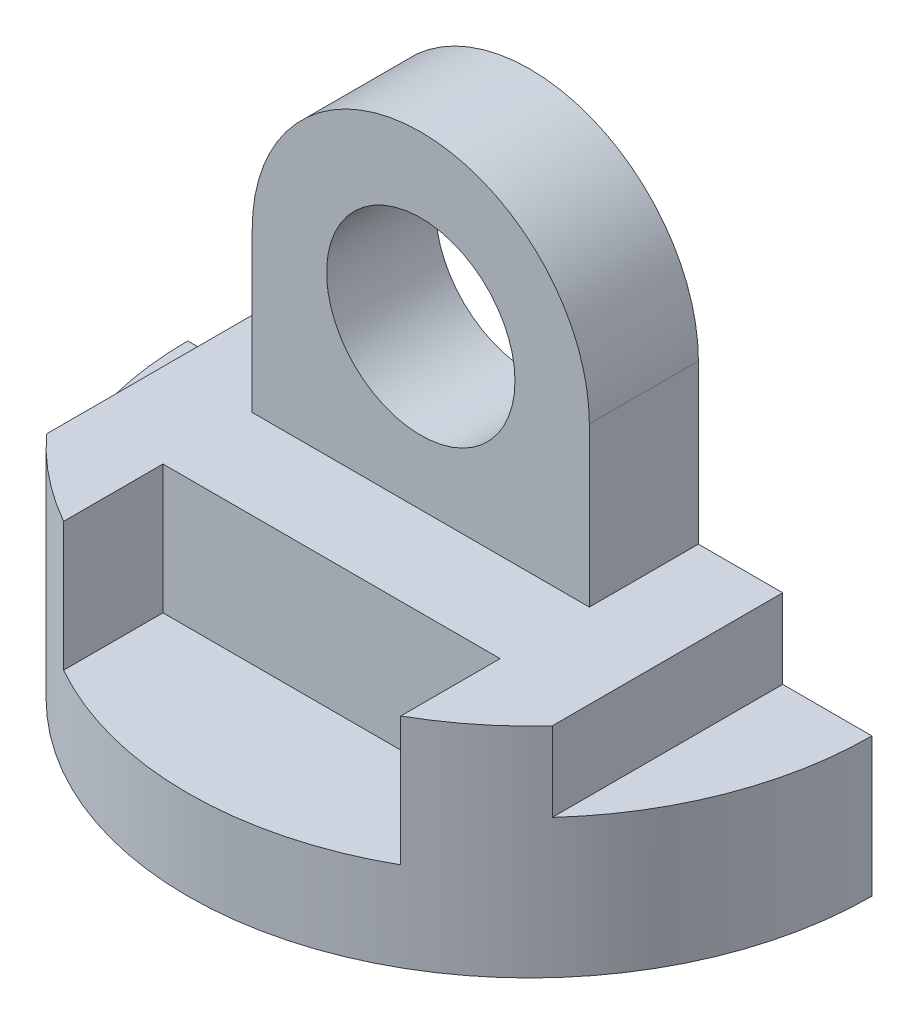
ISO-10303-21;
HEADER;
FILE_DESCRIPTION(('STEP AP214'),'2;1');
FILE_NAME('part.step','',(''),(''),'','','');
FILE_SCHEMA(('AUTOMOTIVE_DESIGN { 1 0 10303 214 1 1 1 1 }'));
ENDSEC;
DATA;
#1=APPLICATION_CONTEXT('core data for automotive mechanical design processes');
#2=APPLICATION_PROTOCOL_DEFINITION('international standard','automotive_design',2000,#1);
#3=PRODUCT_CONTEXT('',#1,'mechanical');
#4=PRODUCT('Part','Part','',(#3));
#5=PRODUCT_RELATED_PRODUCT_CATEGORY('part','',(#4));
#6=PRODUCT_DEFINITION_FORMATION('','',#4);
#7=PRODUCT_DEFINITION_CONTEXT('part definition',#1,'design');
#8=PRODUCT_DEFINITION('design','',#6,#7);
#9=PRODUCT_DEFINITION_SHAPE('','',#8);
#10=(LENGTH_UNIT() NAMED_UNIT(*) SI_UNIT(.MILLI.,.METRE.));
#11=(NAMED_UNIT(*) PLANE_ANGLE_UNIT() SI_UNIT($,.RADIAN.));
#12=(NAMED_UNIT(*) SI_UNIT($,.STERADIAN.) SOLID_ANGLE_UNIT());
#13=UNCERTAINTY_MEASURE_WITH_UNIT(LENGTH_MEASURE(1.E-05),#10,'distance_accuracy_value','');
#14=(GEOMETRIC_REPRESENTATION_CONTEXT(3) GLOBAL_UNCERTAINTY_ASSIGNED_CONTEXT((#13)) GLOBAL_UNIT_ASSIGNED_CONTEXT((#10,
#11,#12)) REPRESENTATION_CONTEXT('',''));
#15=CARTESIAN_POINT('',(0.,0.,0.));
#16=DIRECTION('',(0.,0.,1.));
#17=DIRECTION('',(1.,0.,0.));
#18=AXIS2_PLACEMENT_3D('',#15,#16,#17);
#19=CARTESIAN_POINT('',(0.,88.,0.));
#20=DIRECTION('',(0.,-1.,0.));
#21=DIRECTION('',(0.,0.,-1.));
#22=AXIS2_PLACEMENT_3D('',#19,#20,#21);
#23=CYLINDRICAL_SURFACE('',#22,138.);
#24=CARTESIAN_POINT('',(0.,56.,0.));
#25=DIRECTION('',(0.,1.,0.));
#26=DIRECTION('',(0.,0.,1.));
#27=AXIS2_PLACEMENT_3D('',#24,#25,#26);
#28=CIRCLE('',#27,138.);
#29=CARTESIAN_POINT('',(102.,56.,92.951600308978));
#30=VERTEX_POINT('',#29);
#31=CARTESIAN_POINT('',(138.,56.,0.));
#32=VERTEX_POINT('',#31);
#33=EDGE_CURVE('E143',#30,#32,#28,.T.);
#34=ORIENTED_EDGE('',*,*,#33,.F.);
#35=DIRECTION('',(0.,-1.,0.));
#36=VECTOR('',#35,1.);
#37=CARTESIAN_POINT('',(102.,88.,92.951600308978));
#38=LINE('',#37,#36);
#39=CARTESIAN_POINT('',(102.,88.,92.951600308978));
#40=VERTEX_POINT('',#39);
#41=EDGE_CURVE('E131',#30,#40,#38,.F.);
#42=ORIENTED_EDGE('',*,*,#41,.T.);
#43=CARTESIAN_POINT('',(0.,88.,0.));
#44=DIRECTION('',(0.,1.,0.));
#45=DIRECTION('',(0.,0.,1.));
#46=AXIS2_PLACEMENT_3D('',#43,#44,#45);
#47=CIRCLE('',#46,138.);
#48=CARTESIAN_POINT('',(68.,88.,120.083304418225));
#49=VERTEX_POINT('',#48);
#50=EDGE_CURVE('E141',#49,#40,#47,.T.);
#51=ORIENTED_EDGE('',*,*,#50,.F.);
#52=DIRECTION('',(0.,-1.,0.));
#53=VECTOR('',#52,1.);
#54=CARTESIAN_POINT('',(68.,88.,120.083304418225));
#55=LINE('',#54,#53);
#56=CARTESIAN_POINT('',(68.,36.,120.083304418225));
#57=VERTEX_POINT('',#56);
#58=EDGE_CURVE('E253',#49,#57,#55,.T.);
#59=ORIENTED_EDGE('',*,*,#58,.T.);
#60=CARTESIAN_POINT('',(0.,36.,0.));
#61=DIRECTION('',(0.,-1.,0.));
#62=DIRECTION('',(0.,0.,-1.));
#63=AXIS2_PLACEMENT_3D('',#60,#61,#62);
#64=CIRCLE('',#63,138.);
#65=CARTESIAN_POINT('',(-68.,36.,120.083304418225));
#66=VERTEX_POINT('',#65);
#67=EDGE_CURVE('E173',#57,#66,#64,.T.);
#68=ORIENTED_EDGE('',*,*,#67,.T.);
#69=DIRECTION('',(0.,-1.,0.));
#70=VECTOR('',#69,1.);
#71=CARTESIAN_POINT('',(-68.,88.,120.083304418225));
#72=LINE('',#71,#70);
#73=CARTESIAN_POINT('',(-68.,88.,120.083304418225));
#74=VERTEX_POINT('',#73);
#75=EDGE_CURVE('E257',#66,#74,#72,.F.);
#76=ORIENTED_EDGE('',*,*,#75,.T.);
#77=CARTESIAN_POINT('',(-102.,88.,92.951600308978));
#78=VERTEX_POINT('',#77);
#79=EDGE_CURVE('E149',#78,#74,#47,.T.);
#80=ORIENTED_EDGE('',*,*,#79,.F.);
#81=DIRECTION('',(0.,-1.,0.));
#82=VECTOR('',#81,1.);
#83=CARTESIAN_POINT('',(-102.,88.,92.951600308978));
#84=LINE('',#83,#82);
#85=CARTESIAN_POINT('',(-102.,56.,92.951600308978));
#86=VERTEX_POINT('',#85);
#87=EDGE_CURVE('E53',#86,#78,#84,.F.);
#88=ORIENTED_EDGE('',*,*,#87,.F.);
#89=CARTESIAN_POINT('',(0.,56.,0.));
#90=DIRECTION('',(0.,1.,0.));
#91=DIRECTION('',(0.,0.,1.));
#92=AXIS2_PLACEMENT_3D('',#89,#90,#91);
#93=CIRCLE('',#92,138.);
#94=CARTESIAN_POINT('',(-138.,56.,0.));
#95=VERTEX_POINT('',#94);
#96=EDGE_CURVE('E234',#95,#86,#93,.T.);
#97=ORIENTED_EDGE('',*,*,#96,.F.);
#98=DIRECTION('',(0.,-1.,0.));
#99=VECTOR('',#98,1.);
#100=CARTESIAN_POINT('',(-138.,88.,0.));
#101=LINE('',#100,#99);
#102=CARTESIAN_POINT('',(-138.,0.,0.));
#103=VERTEX_POINT('',#102);
#104=EDGE_CURVE('E169',#95,#103,#101,.T.);
#105=ORIENTED_EDGE('',*,*,#104,.T.);
#106=CARTESIAN_POINT('',(0.,0.,0.));
#107=DIRECTION('',(0.,1.,0.));
#108=DIRECTION('',(0.,0.,1.));
#109=AXIS2_PLACEMENT_3D('',#106,#107,#108);
#110=CIRCLE('',#109,138.);
#111=CARTESIAN_POINT('',(138.,0.,0.));
#112=VERTEX_POINT('',#111);
#113=EDGE_CURVE('E154',#103,#112,#110,.T.);
#114=ORIENTED_EDGE('',*,*,#113,.T.);
#115=DIRECTION('',(0.,-1.,0.));
#116=VECTOR('',#115,1.);
#117=CARTESIAN_POINT('',(138.,88.,0.));
#118=LINE('',#117,#116);
#119=EDGE_CURVE('E177',#32,#112,#118,.T.);
#120=ORIENTED_EDGE('',*,*,#119,.F.);
#121=EDGE_LOOP('',(#34,#42,#51,#59,#68,#76,#80,#88,#97,#105,#114,#120));
#122=FACE_BOUND('',#121,.T.);
#123=ADVANCED_FACE('F31',(#122),#23,.T.);
#124=CARTESIAN_POINT('',(138.,88.,0.));
#125=DIRECTION('',(0.,0.,1.));
#126=DIRECTION('',(1.,0.,0.));
#127=AXIS2_PLACEMENT_3D('',#124,#125,#126);
#128=PLANE('',#127);
#129=CARTESIAN_POINT('',(0.,152.,0.));
#130=DIRECTION('',(0.,0.,1.));
#131=DIRECTION('',(1.,0.,0.));
#132=AXIS2_PLACEMENT_3D('',#129,#130,#131);
#133=CIRCLE('',#132,38.);
#134=CARTESIAN_POINT('',(38.,152.,0.));
#135=VERTEX_POINT('',#134);
#136=EDGE_CURVE('E184',#135,#135,#133,.T.);
#137=ORIENTED_EDGE('',*,*,#136,.T.);
#138=EDGE_LOOP('',(#137));
#139=FACE_BOUND('',#138,.T.);
#140=DIRECTION('',(-1.,0.,0.));
#141=VECTOR('',#140,1.);
#142=CARTESIAN_POINT('',(138.,88.,0.));
#143=LINE('',#142,#141);
#144=CARTESIAN_POINT('',(102.,88.,0.));
#145=VERTEX_POINT('',#144);
#146=CARTESIAN_POINT('',(68.,88.,0.));
#147=VERTEX_POINT('',#146);
#148=EDGE_CURVE('E167',#145,#147,#143,.T.);
#149=ORIENTED_EDGE('',*,*,#148,.F.);
#150=DIRECTION('',(0.,-1.,0.));
#151=VECTOR('',#150,1.);
#152=CARTESIAN_POINT('',(102.,88.,0.));
#153=LINE('',#152,#151);
#154=CARTESIAN_POINT('',(102.,56.,0.));
#155=VERTEX_POINT('',#154);
#156=EDGE_CURVE('E45',#145,#155,#153,.T.);
#157=ORIENTED_EDGE('',*,*,#156,.T.);
#158=DIRECTION('',(-1.,0.,0.));
#159=VECTOR('',#158,1.);
#160=CARTESIAN_POINT('',(138.,56.,0.));
#161=LINE('',#160,#159);
#162=EDGE_CURVE('E11',#32,#155,#161,.T.);
#163=ORIENTED_EDGE('',*,*,#162,.F.);
#164=ORIENTED_EDGE('',*,*,#119,.T.);
#165=DIRECTION('',(-1.,0.,0.));
#166=VECTOR('',#165,1.);
#167=CARTESIAN_POINT('',(138.,0.,0.));
#168=LINE('',#167,#166);
#169=EDGE_CURVE('E150',#112,#103,#168,.T.);
#170=ORIENTED_EDGE('',*,*,#169,.T.);
#171=ORIENTED_EDGE('',*,*,#104,.F.);
#172=DIRECTION('',(-1.,0.,0.));
#173=VECTOR('',#172,1.);
#174=CARTESIAN_POINT('',(138.,56.,0.));
#175=LINE('',#174,#173);
#176=CARTESIAN_POINT('',(-102.,56.,0.));
#177=VERTEX_POINT('',#176);
#178=EDGE_CURVE('E136',#177,#95,#175,.T.);
#179=ORIENTED_EDGE('',*,*,#178,.F.);
#180=DIRECTION('',(0.,-1.,0.));
#181=VECTOR('',#180,1.);
#182=CARTESIAN_POINT('',(-102.,88.,0.));
#183=LINE('',#182,#181);
#184=CARTESIAN_POINT('',(-102.,88.,0.));
#185=VERTEX_POINT('',#184);
#186=EDGE_CURVE('E231',#185,#177,#183,.T.);
#187=ORIENTED_EDGE('',*,*,#186,.F.);
#188=CARTESIAN_POINT('',(-68.,88.,0.));
#189=VERTEX_POINT('',#188);
#190=EDGE_CURVE('E152',#189,#185,#143,.T.);
#191=ORIENTED_EDGE('',*,*,#190,.F.);
#192=DIRECTION('',(0.,-1.,0.));
#193=VECTOR('',#192,1.);
#194=CARTESIAN_POINT('',(-68.,88.,0.));
#195=LINE('',#194,#193);
#196=CARTESIAN_POINT('',(-68.,152.,0.));
#197=VERTEX_POINT('',#196);
#198=EDGE_CURVE('E194',#197,#189,#195,.T.);
#199=ORIENTED_EDGE('',*,*,#198,.F.);
#200=CARTESIAN_POINT('',(0.,152.,0.));
#201=DIRECTION('',(0.,0.,1.));
#202=DIRECTION('',(1.,0.,0.));
#203=AXIS2_PLACEMENT_3D('',#200,#201,#202);
#204=CIRCLE('',#203,68.);
#205=CARTESIAN_POINT('',(68.,152.,0.));
#206=VERTEX_POINT('',#205);
#207=EDGE_CURVE('E183',#206,#197,#204,.T.);
#208=ORIENTED_EDGE('',*,*,#207,.F.);
#209=DIRECTION('',(0.,1.,0.));
#210=VECTOR('',#209,1.);
#211=CARTESIAN_POINT('',(68.,88.,0.));
#212=LINE('',#211,#210);
#213=EDGE_CURVE('E180',#147,#206,#212,.T.);
#214=ORIENTED_EDGE('',*,*,#213,.F.);
#215=EDGE_LOOP('',(#149,#157,#163,#164,#170,#171,#179,#187,#191,#199,#208,#214));
#216=FACE_BOUND('',#215,.T.);
#217=ADVANCED_FACE('F218',(#139,#216),#128,.F.);
#218=CARTESIAN_POINT('',(0.,88.,0.));
#219=DIRECTION('',(0.,1.,0.));
#220=DIRECTION('',(0.,0.,1.));
#221=AXIS2_PLACEMENT_3D('',#218,#219,#220);
#222=PLANE('',#221);
#223=DIRECTION('',(0.,0.,1.));
#224=VECTOR('',#223,1.);
#225=CARTESIAN_POINT('',(102.,88.,0.));
#226=LINE('',#225,#224);
#227=EDGE_CURVE('E38',#145,#40,#226,.T.);
#228=ORIENTED_EDGE('',*,*,#227,.F.);
#229=ORIENTED_EDGE('',*,*,#148,.T.);
#230=DIRECTION('',(0.,0.,-1.));
#231=VECTOR('',#230,1.);
#232=CARTESIAN_POINT('',(68.,88.,44.));
#233=LINE('',#232,#231);
#234=CARTESIAN_POINT('',(68.,88.,44.));
#235=VERTEX_POINT('',#234);
#236=EDGE_CURVE('E187',#235,#147,#233,.T.);
#237=ORIENTED_EDGE('',*,*,#236,.F.);
#238=DIRECTION('',(1.,0.,0.));
#239=VECTOR('',#238,1.);
#240=CARTESIAN_POINT('',(68.,88.,44.));
#241=LINE('',#240,#239);
#242=CARTESIAN_POINT('',(-68.,88.,44.));
#243=VERTEX_POINT('',#242);
#244=EDGE_CURVE('E191',#243,#235,#241,.T.);
#245=ORIENTED_EDGE('',*,*,#244,.F.);
#246=DIRECTION('',(0.,0.,-1.));
#247=VECTOR('',#246,1.);
#248=CARTESIAN_POINT('',(-68.,88.,44.));
#249=LINE('',#248,#247);
#250=EDGE_CURVE('E190',#243,#189,#249,.T.);
#251=ORIENTED_EDGE('',*,*,#250,.T.);
#252=ORIENTED_EDGE('',*,*,#190,.T.);
#253=DIRECTION('',(0.,0.,1.));
#254=VECTOR('',#253,1.);
#255=CARTESIAN_POINT('',(-102.,88.,0.));
#256=LINE('',#255,#254);
#257=EDGE_CURVE('E171',#185,#78,#256,.T.);
#258=ORIENTED_EDGE('',*,*,#257,.T.);
#259=ORIENTED_EDGE('',*,*,#79,.T.);
#260=DIRECTION('',(0.,0.,1.));
#261=VECTOR('',#260,1.);
#262=CARTESIAN_POINT('',(-68.,88.,157.940213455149));
#263=LINE('',#262,#261);
#264=CARTESIAN_POINT('',(-68.,88.,80.));
#265=VERTEX_POINT('',#264);
#266=EDGE_CURVE('E236',#265,#74,#263,.T.);
#267=ORIENTED_EDGE('',*,*,#266,.F.);
#268=DIRECTION('',(-1.,0.,0.));
#269=VECTOR('',#268,1.);
#270=CARTESIAN_POINT('',(-68.,88.,80.));
#271=LINE('',#270,#269);
#272=CARTESIAN_POINT('',(68.,88.,80.));
#273=VERTEX_POINT('',#272);
#274=EDGE_CURVE('E241',#273,#265,#271,.T.);
#275=ORIENTED_EDGE('',*,*,#274,.F.);
#276=DIRECTION('',(0.,0.,-1.));
#277=VECTOR('',#276,1.);
#278=CARTESIAN_POINT('',(68.,88.,0.));
#279=LINE('',#278,#277);
#280=EDGE_CURVE('E148',#49,#273,#279,.T.);
#281=ORIENTED_EDGE('',*,*,#280,.F.);
#282=ORIENTED_EDGE('',*,*,#50,.T.);
#283=EDGE_LOOP('',(#228,#229,#237,#245,#251,#252,#258,#259,#267,#275,#281,#282));
#284=FACE_BOUND('',#283,.T.);
#285=ADVANCED_FACE('F146',(#284),#222,.T.);
#286=CARTESIAN_POINT('',(0.,0.,0.));
#287=DIRECTION('',(0.,1.,0.));
#288=DIRECTION('',(0.,0.,1.));
#289=AXIS2_PLACEMENT_3D('',#286,#287,#288);
#290=PLANE('',#289);
#291=ORIENTED_EDGE('',*,*,#113,.F.);
#292=ORIENTED_EDGE('',*,*,#169,.F.);
#293=EDGE_LOOP('',(#291,#292));
#294=FACE_BOUND('',#293,.T.);
#295=ADVANCED_FACE('F216',(#294),#290,.F.);
#296=CARTESIAN_POINT('',(68.,88.,44.));
#297=DIRECTION('',(-1.,0.,0.));
#298=DIRECTION('',(0.,-1.,0.));
#299=AXIS2_PLACEMENT_3D('',#296,#297,#298);
#300=PLANE('',#299);
#301=ORIENTED_EDGE('',*,*,#213,.T.);
#302=DIRECTION('',(0.,0.,-1.));
#303=VECTOR('',#302,1.);
#304=CARTESIAN_POINT('',(68.,152.,44.));
#305=LINE('',#304,#303);
#306=CARTESIAN_POINT('',(68.,152.,44.));
#307=VERTEX_POINT('',#306);
#308=EDGE_CURVE('E158',#307,#206,#305,.T.);
#309=ORIENTED_EDGE('',*,*,#308,.F.);
#310=DIRECTION('',(0.,1.,0.));
#311=VECTOR('',#310,1.);
#312=CARTESIAN_POINT('',(68.,88.,44.));
#313=LINE('',#312,#311);
#314=EDGE_CURVE('E195',#235,#307,#313,.T.);
#315=ORIENTED_EDGE('',*,*,#314,.F.);
#316=ORIENTED_EDGE('',*,*,#236,.T.);
#317=EDGE_LOOP('',(#301,#309,#315,#316));
#318=FACE_BOUND('',#317,.T.);
#319=ADVANCED_FACE('F277',(#318),#300,.F.);
#320=CARTESIAN_POINT('',(0.,152.,44.));
#321=DIRECTION('',(0.,0.,-1.));
#322=DIRECTION('',(-1.,0.,0.));
#323=AXIS2_PLACEMENT_3D('',#320,#321,#322);
#324=CYLINDRICAL_SURFACE('',#323,68.);
#325=ORIENTED_EDGE('',*,*,#207,.T.);
#326=DIRECTION('',(0.,0.,-1.));
#327=VECTOR('',#326,1.);
#328=CARTESIAN_POINT('',(-68.,152.,44.));
#329=LINE('',#328,#327);
#330=CARTESIAN_POINT('',(-68.,152.,44.));
#331=VERTEX_POINT('',#330);
#332=EDGE_CURVE('E198',#331,#197,#329,.T.);
#333=ORIENTED_EDGE('',*,*,#332,.F.);
#334=CARTESIAN_POINT('',(0.,152.,44.));
#335=DIRECTION('',(0.,0.,1.));
#336=DIRECTION('',(1.,0.,0.));
#337=AXIS2_PLACEMENT_3D('',#334,#335,#336);
#338=CIRCLE('',#337,68.);
#339=EDGE_CURVE('E267',#307,#331,#338,.T.);
#340=ORIENTED_EDGE('',*,*,#339,.F.);
#341=ORIENTED_EDGE('',*,*,#308,.T.);
#342=EDGE_LOOP('',(#325,#333,#340,#341));
#343=FACE_BOUND('',#342,.T.);
#344=ADVANCED_FACE('F280',(#343),#324,.T.);
#345=CARTESIAN_POINT('',(-68.,88.,44.));
#346=DIRECTION('',(1.,0.,0.));
#347=DIRECTION('',(0.,1.,0.));
#348=AXIS2_PLACEMENT_3D('',#345,#346,#347);
#349=PLANE('',#348);
#350=ORIENTED_EDGE('',*,*,#198,.T.);
#351=ORIENTED_EDGE('',*,*,#250,.F.);
#352=DIRECTION('',(0.,-1.,0.));
#353=VECTOR('',#352,1.);
#354=CARTESIAN_POINT('',(-68.,88.,44.));
#355=LINE('',#354,#353);
#356=EDGE_CURVE('E269',#331,#243,#355,.T.);
#357=ORIENTED_EDGE('',*,*,#356,.F.);
#358=ORIENTED_EDGE('',*,*,#332,.T.);
#359=EDGE_LOOP('',(#350,#351,#357,#358));
#360=FACE_BOUND('',#359,.T.);
#361=ADVANCED_FACE('F281',(#360),#349,.F.);
#362=CARTESIAN_POINT('',(0.,152.,44.));
#363=DIRECTION('',(0.,0.,1.));
#364=DIRECTION('',(1.,0.,0.));
#365=AXIS2_PLACEMENT_3D('',#362,#363,#364);
#366=PLANE('',#365);
#367=CARTESIAN_POINT('',(0.,152.,44.));
#368=DIRECTION('',(0.,0.,1.));
#369=DIRECTION('',(1.,0.,0.));
#370=AXIS2_PLACEMENT_3D('',#367,#368,#369);
#371=CIRCLE('',#370,38.);
#372=CARTESIAN_POINT('',(38.,152.,44.));
#373=VERTEX_POINT('',#372);
#374=EDGE_CURVE('E260',#373,#373,#371,.T.);
#375=ORIENTED_EDGE('',*,*,#374,.F.);
#376=EDGE_LOOP('',(#375));
#377=FACE_BOUND('',#376,.T.);
#378=ORIENTED_EDGE('',*,*,#314,.T.);
#379=ORIENTED_EDGE('',*,*,#339,.T.);
#380=ORIENTED_EDGE('',*,*,#356,.T.);
#381=ORIENTED_EDGE('',*,*,#244,.T.);
#382=EDGE_LOOP('',(#378,#379,#380,#381));
#383=FACE_BOUND('',#382,.T.);
#384=ADVANCED_FACE('F273',(#377,#383),#366,.T.);
#385=CARTESIAN_POINT('',(0.,152.,-5.00000000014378E-05));
#386=DIRECTION('',(0.,0.,1.));
#387=DIRECTION('',(1.,0.,0.));
#388=AXIS2_PLACEMENT_3D('',#385,#386,#387);
#389=CYLINDRICAL_SURFACE('',#388,38.);
#390=ORIENTED_EDGE('',*,*,#374,.T.);
#391=EDGE_LOOP('',(#390));
#392=FACE_BOUND('',#391,.T.);
#393=ORIENTED_EDGE('',*,*,#136,.F.);
#394=EDGE_LOOP('',(#393));
#395=FACE_BOUND('',#394,.T.);
#396=ADVANCED_FACE('F303',(#392,#395),#389,.F.);
#397=CARTESIAN_POINT('',(-68.,36.,80.));
#398=DIRECTION('',(0.,-1.,0.));
#399=DIRECTION('',(0.,0.,-1.));
#400=AXIS2_PLACEMENT_3D('',#397,#398,#399);
#401=PLANE('',#400);
#402=DIRECTION('',(0.,0.,-1.));
#403=VECTOR('',#402,1.);
#404=CARTESIAN_POINT('',(68.,36.,80.));
#405=LINE('',#404,#403);
#406=CARTESIAN_POINT('',(68.,36.,80.));
#407=VERTEX_POINT('',#406);
#408=EDGE_CURVE('E240',#57,#407,#405,.T.);
#409=ORIENTED_EDGE('',*,*,#408,.T.);
#410=DIRECTION('',(-1.,0.,0.));
#411=VECTOR('',#410,1.);
#412=CARTESIAN_POINT('',(-68.,36.,80.));
#413=LINE('',#412,#411);
#414=CARTESIAN_POINT('',(-68.,36.,80.));
#415=VERTEX_POINT('',#414);
#416=EDGE_CURVE('E243',#407,#415,#413,.T.);
#417=ORIENTED_EDGE('',*,*,#416,.T.);
#418=DIRECTION('',(0.,0.,1.));
#419=VECTOR('',#418,1.);
#420=CARTESIAN_POINT('',(-68.,36.,157.940213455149));
#421=LINE('',#420,#419);
#422=EDGE_CURVE('E237',#415,#66,#421,.T.);
#423=ORIENTED_EDGE('',*,*,#422,.T.);
#424=ORIENTED_EDGE('',*,*,#67,.F.);
#425=EDGE_LOOP('',(#409,#417,#423,#424));
#426=FACE_BOUND('',#425,.T.);
#427=ADVANCED_FACE('F301',(#426),#401,.F.);
#428=CARTESIAN_POINT('',(-68.,36.,157.940213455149));
#429=DIRECTION('',(-1.,0.,0.));
#430=DIRECTION('',(0.,0.,1.));
#431=AXIS2_PLACEMENT_3D('',#428,#429,#430);
#432=PLANE('',#431);
#433=ORIENTED_EDGE('',*,*,#422,.F.);
#434=DIRECTION('',(0.,1.,0.));
#435=VECTOR('',#434,1.);
#436=CARTESIAN_POINT('',(-68.,36.,80.));
#437=LINE('',#436,#435);
#438=EDGE_CURVE('E251',#415,#265,#437,.T.);
#439=ORIENTED_EDGE('',*,*,#438,.T.);
#440=ORIENTED_EDGE('',*,*,#266,.T.);
#441=ORIENTED_EDGE('',*,*,#75,.F.);
#442=EDGE_LOOP('',(#433,#439,#440,#441));
#443=FACE_BOUND('',#442,.T.);
#444=ADVANCED_FACE('F292',(#443),#432,.F.);
#445=CARTESIAN_POINT('',(68.,36.,80.));
#446=DIRECTION('',(1.,0.,0.));
#447=DIRECTION('',(0.,0.,-1.));
#448=AXIS2_PLACEMENT_3D('',#445,#446,#447);
#449=PLANE('',#448);
#450=ORIENTED_EDGE('',*,*,#280,.T.);
#451=DIRECTION('',(0.,1.,0.));
#452=VECTOR('',#451,1.);
#453=CARTESIAN_POINT('',(68.,36.,80.));
#454=LINE('',#453,#452);
#455=EDGE_CURVE('E246',#407,#273,#454,.T.);
#456=ORIENTED_EDGE('',*,*,#455,.F.);
#457=ORIENTED_EDGE('',*,*,#408,.F.);
#458=ORIENTED_EDGE('',*,*,#58,.F.);
#459=EDGE_LOOP('',(#450,#456,#457,#458));
#460=FACE_BOUND('',#459,.T.);
#461=ADVANCED_FACE('F299',(#460),#449,.F.);
#462=CARTESIAN_POINT('',(-68.,36.,80.));
#463=DIRECTION('',(0.,0.,-1.));
#464=DIRECTION('',(-1.,0.,0.));
#465=AXIS2_PLACEMENT_3D('',#462,#463,#464);
#466=PLANE('',#465);
#467=ORIENTED_EDGE('',*,*,#274,.T.);
#468=ORIENTED_EDGE('',*,*,#438,.F.);
#469=ORIENTED_EDGE('',*,*,#416,.F.);
#470=ORIENTED_EDGE('',*,*,#455,.T.);
#471=EDGE_LOOP('',(#467,#468,#469,#470));
#472=FACE_BOUND('',#471,.T.);
#473=ADVANCED_FACE('F295',(#472),#466,.F.);
#474=CARTESIAN_POINT('',(-156.848614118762,56.,-10.1211507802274));
#475=DIRECTION('',(0.,1.,0.));
#476=DIRECTION('',(1.,0.,0.));
#477=AXIS2_PLACEMENT_3D('',#474,#475,#476);
#478=PLANE('',#477);
#479=ORIENTED_EDGE('',*,*,#96,.T.);
#480=DIRECTION('',(0.,0.,1.));
#481=VECTOR('',#480,1.);
#482=CARTESIAN_POINT('',(-102.,56.,-10.1211507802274));
#483=LINE('',#482,#481);
#484=EDGE_CURVE('E229',#177,#86,#483,.T.);
#485=ORIENTED_EDGE('',*,*,#484,.F.);
#486=ORIENTED_EDGE('',*,*,#178,.T.);
#487=EDGE_LOOP('',(#479,#485,#486));
#488=FACE_BOUND('',#487,.T.);
#489=ADVANCED_FACE('F287',(#488),#478,.T.);
#490=CARTESIAN_POINT('',(-102.,56.,-10.1211507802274));
#491=DIRECTION('',(-1.,0.,0.));
#492=DIRECTION('',(0.,0.,1.));
#493=AXIS2_PLACEMENT_3D('',#490,#491,#492);
#494=PLANE('',#493);
#495=ORIENTED_EDGE('',*,*,#87,.T.);
#496=ORIENTED_EDGE('',*,*,#257,.F.);
#497=ORIENTED_EDGE('',*,*,#186,.T.);
#498=ORIENTED_EDGE('',*,*,#484,.T.);
#499=EDGE_LOOP('',(#495,#496,#497,#498));
#500=FACE_BOUND('',#499,.T.);
#501=ADVANCED_FACE('F285',(#500),#494,.T.);
#502=CARTESIAN_POINT('',(156.848614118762,56.,-10.1211507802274));
#503=DIRECTION('',(0.,1.,0.));
#504=DIRECTION('',(-1.,0.,0.));
#505=AXIS2_PLACEMENT_3D('',#502,#503,#504);
#506=PLANE('',#505);
#507=ORIENTED_EDGE('',*,*,#33,.T.);
#508=ORIENTED_EDGE('',*,*,#162,.T.);
#509=DIRECTION('',(0.,0.,1.));
#510=VECTOR('',#509,1.);
#511=CARTESIAN_POINT('',(102.,56.,-10.1211507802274));
#512=LINE('',#511,#510);
#513=EDGE_CURVE('E224',#155,#30,#512,.T.);
#514=ORIENTED_EDGE('',*,*,#513,.T.);
#515=EDGE_LOOP('',(#507,#508,#514));
#516=FACE_BOUND('',#515,.T.);
#517=ADVANCED_FACE('F223',(#516),#506,.T.);
#518=CARTESIAN_POINT('',(102.,56.,-10.1211507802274));
#519=DIRECTION('',(-1.,0.,0.));
#520=DIRECTION('',(0.,0.,1.));
#521=AXIS2_PLACEMENT_3D('',#518,#519,#520);
#522=PLANE('',#521);
#523=ORIENTED_EDGE('',*,*,#513,.F.);
#524=ORIENTED_EDGE('',*,*,#156,.F.);
#525=ORIENTED_EDGE('',*,*,#227,.T.);
#526=ORIENTED_EDGE('',*,*,#41,.F.);
#527=EDGE_LOOP('',(#523,#524,#525,#526));
#528=FACE_BOUND('',#527,.T.);
#529=ADVANCED_FACE('F130',(#528),#522,.F.);
#530=CLOSED_SHELL('',(#123,#217,#285,#295,#319,#344,#361,#384,#396,#427,#444,#461,#473,#489,
#501,#517,#529));
#531=MANIFOLD_SOLID_BREP('B2',#530);
#532=ADVANCED_BREP_SHAPE_REPRESENTATION('',(#18,#531),#14);
#533=SHAPE_DEFINITION_REPRESENTATION(#9,#532);
ENDSEC;
END-ISO-10303-21;
